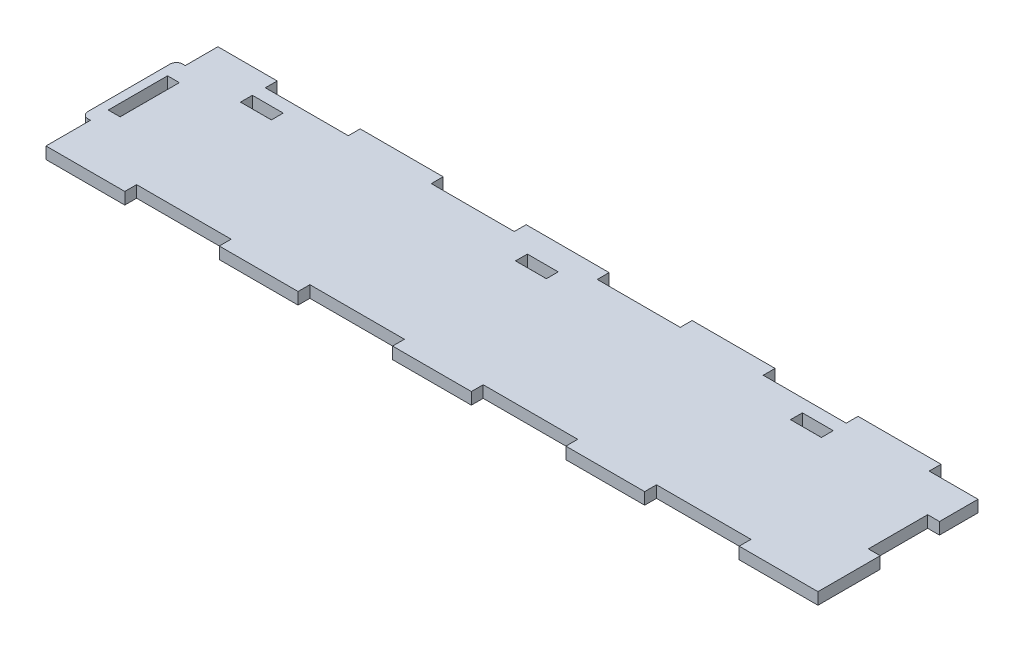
from build123d import *

# Parameters (mm, degrees)
SKETCH_1_W      = 3.0099
SKETCH_1_H      = 15.0497
SKETCH_1_W_2    = 7.8384
SKETCH_1_H_2    = 3.01
SKETCH_1_W_3    = 7.8383
SKETCH_1_W_4    = 7.8382
EXTRUDE_1_DEPTH = 3


with BuildPart() as part:
    # Sketch 1 → Extrude 1 (new body)
    with BuildSketch(Plane(origin=(0, 0, 0), x_dir=(1, 0, 0), z_dir=(0, 1, 0))):
        with BuildLine():
            Line((-194.910873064, 67.923002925), (-174.910873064, 67.923002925))
            Line((-174.910873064, 67.923002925), (-174.910873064, 70.923002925))
            Line((-174.910873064, 70.923002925), (-150.910873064, 70.923002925))
            Line((-150.910873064, 70.923002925), (-150.910873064, 67.923002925))
            Line((-150.910873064, 67.923002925), (-130.910873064, 67.923002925))
            Line((-130.910873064, 67.923002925), (-130.910873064, 70.923002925))
            Line((-130.910873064, 70.923002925), (-106.910873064, 70.923002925))
            Line((-106.910873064, 70.923002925), (-106.910873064, 67.923002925))
            Line((-106.910873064, 67.923002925), (-86.910873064, 67.923002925))
            Line((-86.910873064, 67.923002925), (-86.910873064, 70.923002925))
            Line((-86.910873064, 70.923002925), (-62.910873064, 70.923002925))
            Line((-62.910873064, 70.923002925), (-62.910873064, 67.923002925))
            Line((-62.910873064, 67.923002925), (-42.910873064, 67.923002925))
            Line((-42.910873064, 67.923002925), (-42.910873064, 70.923002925))
            Line((-42.910873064, 70.923002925), (-18.910873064, 70.923002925))
            Line((-18.910873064, 70.923002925), (-18.910873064, 67.923002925))
            Line((-18.910873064, 67.923002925), (1.089126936, 67.923002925))
            Line((1.089126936, 67.923002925), (1.089126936, 83.725602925))
            Line((1.089126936, 83.725602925), (-1.910873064, 83.725602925))
            Line((-1.910873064, 83.725602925), (-1.910873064, 98.775302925))
            Line((-1.910873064, 98.775302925), (1.089126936, 98.775302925))
            Line((1.089126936, 98.775302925), (1.089126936, 108.557702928))
            Line((1.089126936, 108.557702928), (-11.302073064, 108.557702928))
            Line((-11.302073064, 108.557702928), (-11.302073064, 111.567602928))
            Line((-11.302073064, 111.567602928), (-32.371773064, 111.567602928))
            Line((-32.371773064, 111.567602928), (-32.371773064, 108.557702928))
            Line((-32.371773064, 108.557702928), (-53.441773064, 108.557702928))
            Line((-53.441773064, 108.557702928), (-53.441773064, 111.567602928))
            Line((-53.441773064, 111.567602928), (-74.511473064, 111.567602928))
            Line((-74.511473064, 111.567602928), (-74.511473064, 108.557702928))
            Line((-74.511473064, 108.557702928), (-95.581573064, 108.557702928))
            Line((-95.581573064, 108.557702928), (-95.581573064, 111.567602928))
            Line((-95.581573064, 111.567602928), (-116.651273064, 111.567602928))
            Line((-116.651273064, 111.567602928), (-116.651273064, 108.557702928))
            Line((-116.651273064, 108.557702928), (-137.721173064, 108.557702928))
            Line((-137.721173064, 108.557702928), (-137.721173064, 111.567602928))
            Line((-137.721173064, 111.567602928), (-158.791173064, 111.567602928))
            Line((-158.791173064, 111.567602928), (-158.791173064, 108.557702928))
            Line((-158.791173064, 108.557702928), (-179.860973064, 108.557702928))
            Line((-179.860973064, 108.557702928), (-179.860973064, 111.567602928))
            Line((-179.860973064, 111.567602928), (-194.910873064, 111.567602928))
            Line((-194.910873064, 111.567602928), (-194.910873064, 103.281602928))
            Line((-194.910873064, 103.281602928), (-195.58517306, 103.281602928))
            ThreePointArc((-195.58517306, 103.281602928), (-196.704735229, 102.817865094), (-197.168473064, 101.698302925))
            Line((-197.168473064, 101.698302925), (-197.168473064, 80.802602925))
            ThreePointArc((-197.168473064, 80.802602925), (-196.704705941, 79.682970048), (-195.585073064, 79.219202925))
            Line((-195.585073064, 79.219202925), (-194.910873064, 79.219202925))
            Line((-194.910873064, 79.219202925), (-194.910873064, 67.923002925))
        make_face()
        with Locations((-193.405923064, 91.250452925)):
            Rectangle(SKETCH_1_W, SKETCH_1_H, mode=Mode.SUBTRACT)
        with Locations((-175.941773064, 103.760602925)):
            Rectangle(SKETCH_1_W_2, SKETCH_1_H_2, mode=Mode.SUBTRACT)
        with Locations((-36.290923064, 103.760602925)):
            Rectangle(SKETCH_1_W_3, SKETCH_1_H_2, mode=Mode.SUBTRACT)
        with Locations((-106.116473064, 103.760602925)):
            Rectangle(SKETCH_1_W_4, SKETCH_1_H_2, mode=Mode.SUBTRACT)
    extrude(amount=EXTRUDE_1_DEPTH)


solid = part.part
